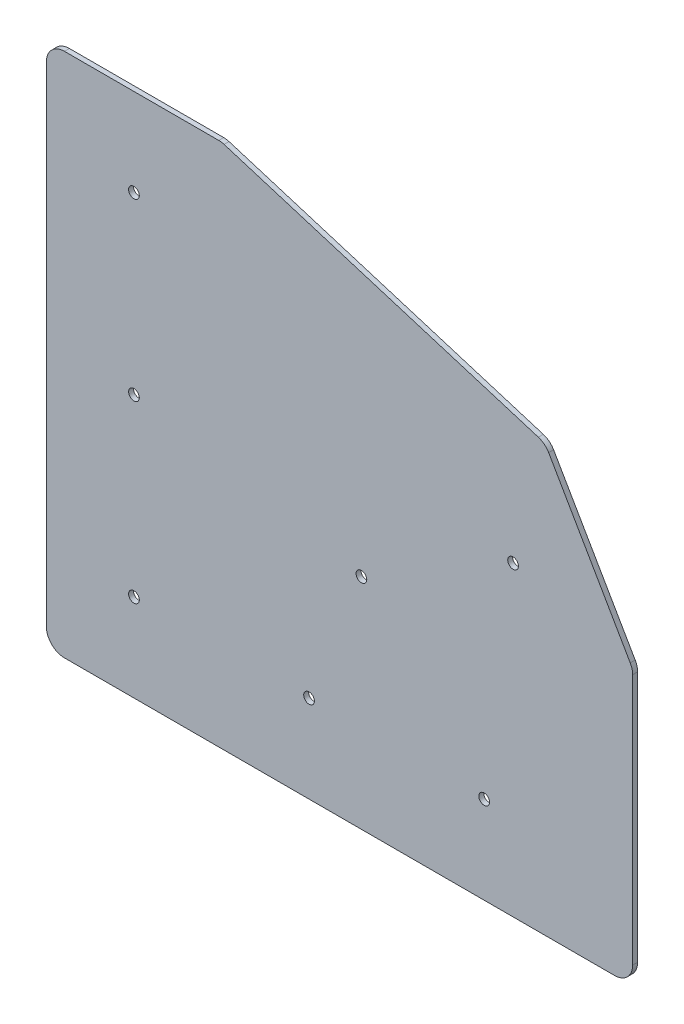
ISO-10303-21;
HEADER;
FILE_DESCRIPTION(('STEP AP214'),'2;1');
FILE_NAME('part.step','',(''),(''),'','','');
FILE_SCHEMA(('AUTOMOTIVE_DESIGN { 1 0 10303 214 1 1 1 1 }'));
ENDSEC;
DATA;
#1=APPLICATION_CONTEXT('core data for automotive mechanical design processes');
#2=APPLICATION_PROTOCOL_DEFINITION('international standard','automotive_design',2000,#1);
#3=PRODUCT_CONTEXT('',#1,'mechanical');
#4=PRODUCT('Part','Part','',(#3));
#5=PRODUCT_RELATED_PRODUCT_CATEGORY('part','',(#4));
#6=PRODUCT_DEFINITION_FORMATION('','',#4);
#7=PRODUCT_DEFINITION_CONTEXT('part definition',#1,'design');
#8=PRODUCT_DEFINITION('design','',#6,#7);
#9=PRODUCT_DEFINITION_SHAPE('','',#8);
#10=(LENGTH_UNIT() NAMED_UNIT(*) SI_UNIT(.MILLI.,.METRE.));
#11=(NAMED_UNIT(*) PLANE_ANGLE_UNIT() SI_UNIT($,.RADIAN.));
#12=(NAMED_UNIT(*) SI_UNIT($,.STERADIAN.) SOLID_ANGLE_UNIT());
#13=UNCERTAINTY_MEASURE_WITH_UNIT(LENGTH_MEASURE(1.E-05),#10,'distance_accuracy_value','');
#14=(GEOMETRIC_REPRESENTATION_CONTEXT(3) GLOBAL_UNCERTAINTY_ASSIGNED_CONTEXT((#13)) GLOBAL_UNIT_ASSIGNED_CONTEXT((#10,
#11,#12)) REPRESENTATION_CONTEXT('',''));
#15=CARTESIAN_POINT('',(0.,0.,0.));
#16=DIRECTION('',(0.,0.,1.));
#17=DIRECTION('',(1.,0.,0.));
#18=AXIS2_PLACEMENT_3D('',#15,#16,#17);
#19=CARTESIAN_POINT('',(180.7124135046,5.55625,1.524));
#20=DIRECTION('',(1.,0.,0.));
#21=DIRECTION('',(0.,0.,-1.));
#22=AXIS2_PLACEMENT_3D('',#19,#20,#21);
#23=PLANE('',#22);
#24=DIRECTION('',(0.,1.,0.));
#25=VECTOR('',#24,1.);
#26=CARTESIAN_POINT('',(180.7124135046,80.9625,1.524));
#27=LINE('',#26,#25);
#28=CARTESIAN_POINT('',(180.7124135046,5.55624999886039,1.524));
#29=VERTEX_POINT('',#28);
#30=CARTESIAN_POINT('',(180.7124135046,83.0893467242,1.524));
#31=VERTEX_POINT('',#30);
#32=EDGE_CURVE('E199',#29,#31,#27,.T.);
#33=ORIENTED_EDGE('',*,*,#32,.F.);
#34=DIRECTION('',(0.,0.,1.));
#35=VECTOR('',#34,1.);
#36=CARTESIAN_POINT('',(180.7124135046,5.55624999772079,0.762));
#37=LINE('',#36,#35);
#38=CARTESIAN_POINT('',(180.7124135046,5.55624999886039,0.));
#39=VERTEX_POINT('',#38);
#40=EDGE_CURVE('E129',#29,#39,#37,.F.);
#41=ORIENTED_EDGE('',*,*,#40,.T.);
#42=DIRECTION('',(0.,1.,0.));
#43=VECTOR('',#42,1.);
#44=CARTESIAN_POINT('',(180.7124135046,80.9625,0.));
#45=LINE('',#44,#43);
#46=CARTESIAN_POINT('',(180.7124135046,83.0893467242,0.));
#47=VERTEX_POINT('',#46);
#48=EDGE_CURVE('E223',#39,#47,#45,.T.);
#49=ORIENTED_EDGE('',*,*,#48,.T.);
#50=DIRECTION('',(0.,0.,-1.));
#51=VECTOR('',#50,1.);
#52=CARTESIAN_POINT('',(180.7124135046,83.0893467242,0.762));
#53=LINE('',#52,#51);
#54=EDGE_CURVE('E159',#47,#31,#53,.F.);
#55=ORIENTED_EDGE('',*,*,#54,.T.);
#56=EDGE_LOOP('',(#33,#41,#49,#55));
#57=FACE_BOUND('',#56,.T.);
#58=ADVANCED_FACE('F16',(#57),#23,.T.);
#59=CARTESIAN_POINT('',(175.1561635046,83.0893467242,0.));
#60=DIRECTION('',(0.,0.,1.));
#61=DIRECTION('',(1.,0.,0.));
#62=AXIS2_PLACEMENT_3D('',#59,#60,#61);
#63=CYLINDRICAL_SURFACE('',#62,5.55625000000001);
#64=ORIENTED_EDGE('',*,*,#54,.F.);
#65=CARTESIAN_POINT('',(175.1561635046,83.0893467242,0.));
#66=DIRECTION('',(0.,0.,1.));
#67=DIRECTION('',(1.,0.,0.));
#68=AXIS2_PLACEMENT_3D('',#65,#66,#67);
#69=CIRCLE('',#68,5.55625000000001);
#70=CARTESIAN_POINT('',(179.968017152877,85.8674717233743,0.));
#71=VERTEX_POINT('',#70);
#72=EDGE_CURVE('E220',#47,#71,#69,.T.);
#73=ORIENTED_EDGE('',*,*,#72,.T.);
#74=DIRECTION('',(0.,0.,1.));
#75=VECTOR('',#74,1.);
#76=CARTESIAN_POINT('',(179.9680171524,85.8674717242,0.762));
#77=LINE('',#76,#75);
#78=CARTESIAN_POINT('',(179.968017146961,85.8674717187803,1.524));
#79=VERTEX_POINT('',#78);
#80=EDGE_CURVE('E156',#71,#79,#77,.T.);
#81=ORIENTED_EDGE('',*,*,#80,.T.);
#82=CARTESIAN_POINT('',(175.1561635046,83.0893467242,1.524));
#83=DIRECTION('',(0.,0.,1.));
#84=DIRECTION('',(1.,0.,0.));
#85=AXIS2_PLACEMENT_3D('',#82,#83,#84);
#86=CIRCLE('',#85,5.55625000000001);
#87=EDGE_CURVE('E197',#31,#79,#86,.T.);
#88=ORIENTED_EDGE('',*,*,#87,.F.);
#89=EDGE_LOOP('',(#64,#73,#81,#88));
#90=FACE_BOUND('',#89,.T.);
#91=ADVANCED_FACE('F266',(#90),#63,.T.);
#92=CARTESIAN_POINT('',(154.8176796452,129.4291341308,0.));
#93=DIRECTION('',(-0.866025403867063,-0.49999999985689,0.));
#94=DIRECTION('',(0.49999999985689,-0.866025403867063,0.));
#95=AXIS2_PLACEMENT_3D('',#92,#93,#94);
#96=PLANE('',#95);
#97=ORIENTED_EDGE('',*,*,#80,.F.);
#98=DIRECTION('',(0.49999999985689,-0.866025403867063,0.));
#99=VECTOR('',#98,1.);
#100=CARTESIAN_POINT('',(154.8176796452,129.4291341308,0.));
#101=LINE('',#100,#99);
#102=CARTESIAN_POINT('',(154.817679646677,129.429134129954,0.));
#103=VERTEX_POINT('',#102);
#104=EDGE_CURVE('E218',#71,#103,#101,.F.);
#105=ORIENTED_EDGE('',*,*,#104,.T.);
#106=DIRECTION('',(0.,0.,-1.));
#107=VECTOR('',#106,1.);
#108=CARTESIAN_POINT('',(154.817679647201,129.429134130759,0.762));
#109=LINE('',#108,#107);
#110=CARTESIAN_POINT('',(154.817679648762,129.429134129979,1.524));
#111=VERTEX_POINT('',#110);
#112=EDGE_CURVE('E104',#103,#111,#109,.F.);
#113=ORIENTED_EDGE('',*,*,#112,.T.);
#114=DIRECTION('',(-0.499999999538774,0.866025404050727,0.));
#115=VECTOR('',#114,1.);
#116=CARTESIAN_POINT('',(179.968017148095,85.867471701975,1.524));
#117=LINE('',#116,#115);
#118=EDGE_CURVE('E195',#79,#111,#117,.T.);
#119=ORIENTED_EDGE('',*,*,#118,.F.);
#120=EDGE_LOOP('',(#97,#105,#113,#119));
#121=FACE_BOUND('',#120,.T.);
#122=ADVANCED_FACE('F269',(#121),#96,.F.);
#123=CARTESIAN_POINT('',(150.0058259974,126.6510091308,1.524));
#124=DIRECTION('',(0.,0.,-1.));
#125=DIRECTION('',(0.,1.,0.));
#126=AXIS2_PLACEMENT_3D('',#123,#124,#125);
#127=CYLINDRICAL_SURFACE('',#126,5.55625000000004);
#128=ORIENTED_EDGE('',*,*,#112,.F.);
#129=CARTESIAN_POINT('',(150.0058259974,126.6510091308,0.));
#130=DIRECTION('',(0.,0.,-1.));
#131=DIRECTION('',(0.,1.,0.));
#132=AXIS2_PLACEMENT_3D('',#129,#130,#131);
#133=CIRCLE('',#132,5.55625000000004);
#134=CARTESIAN_POINT('',(151.635503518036,131.962888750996,0.));
#135=VERTEX_POINT('',#134);
#136=EDGE_CURVE('E20',#103,#135,#133,.F.);
#137=ORIENTED_EDGE('',*,*,#136,.T.);
#138=DIRECTION('',(0.,0.,1.));
#139=VECTOR('',#138,1.);
#140=CARTESIAN_POINT('',(151.6355035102,131.9628887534,0.762));
#141=LINE('',#140,#139);
#142=CARTESIAN_POINT('',(151.63550352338,131.962888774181,1.524));
#143=VERTEX_POINT('',#142);
#144=EDGE_CURVE('E111',#135,#143,#141,.T.);
#145=ORIENTED_EDGE('',*,*,#144,.T.);
#146=CARTESIAN_POINT('',(150.0058259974,126.6510091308,1.524));
#147=DIRECTION('',(0.,0.,-1.));
#148=DIRECTION('',(0.,1.,0.));
#149=AXIS2_PLACEMENT_3D('',#146,#147,#148);
#150=CIRCLE('',#149,5.55625000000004);
#151=EDGE_CURVE('E193',#111,#143,#150,.F.);
#152=ORIENTED_EDGE('',*,*,#151,.F.);
#153=EDGE_LOOP('',(#128,#137,#145,#152));
#154=FACE_BOUND('',#153,.T.);
#155=ADVANCED_FACE('F128',(#154),#127,.T.);
#156=CARTESIAN_POINT('',(54.771517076,161.6806296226,0.));
#157=DIRECTION('',(-0.29330529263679,-0.956018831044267,0.));
#158=DIRECTION('',(0.956018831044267,-0.29330529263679,0.));
#159=AXIS2_PLACEMENT_3D('',#156,#157,#158);
#160=PLANE('',#159);
#161=ORIENTED_EDGE('',*,*,#144,.F.);
#162=DIRECTION('',(0.956018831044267,-0.29330529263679,0.));
#163=VECTOR('',#162,1.);
#164=CARTESIAN_POINT('',(54.771517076,161.6806296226,0.));
#165=LINE('',#164,#163);
#166=CARTESIAN_POINT('',(54.771517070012,161.680629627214,0.));
#167=VERTEX_POINT('',#166);
#168=EDGE_CURVE('E115',#135,#167,#165,.F.);
#169=ORIENTED_EDGE('',*,*,#168,.T.);
#170=DIRECTION('',(0.,0.,-1.));
#171=VECTOR('',#170,1.);
#172=CARTESIAN_POINT('',(54.7715170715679,161.680629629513,0.762));
#173=LINE('',#172,#171);
#174=CARTESIAN_POINT('',(54.7715170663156,161.680629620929,1.524));
#175=VERTEX_POINT('',#174);
#176=EDGE_CURVE('E117',#167,#175,#173,.F.);
#177=ORIENTED_EDGE('',*,*,#176,.T.);
#178=DIRECTION('',(-0.956018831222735,0.293305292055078,0.));
#179=VECTOR('',#178,1.);
#180=CARTESIAN_POINT('',(151.635503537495,131.962888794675,1.524));
#181=LINE('',#180,#179);
#182=EDGE_CURVE('E116',#143,#175,#181,.T.);
#183=ORIENTED_EDGE('',*,*,#182,.F.);
#184=EDGE_LOOP('',(#161,#169,#177,#183));
#185=FACE_BOUND('',#184,.T.);
#186=ADVANCED_FACE('F113',(#185),#160,.F.);
#187=CARTESIAN_POINT('',(53.1418395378,156.36875,1.524));
#188=DIRECTION('',(0.,0.,-1.));
#189=DIRECTION('',(0.,1.,0.));
#190=AXIS2_PLACEMENT_3D('',#187,#188,#189);
#191=CYLINDRICAL_SURFACE('',#190,5.55624999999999);
#192=ORIENTED_EDGE('',*,*,#176,.F.);
#193=CARTESIAN_POINT('',(53.1418395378,156.36875,0.));
#194=DIRECTION('',(0.,0.,-1.));
#195=DIRECTION('',(0.,1.,0.));
#196=AXIS2_PLACEMENT_3D('',#193,#194,#195);
#197=CIRCLE('',#196,5.55624999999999);
#198=CARTESIAN_POINT('',(53.1418395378,161.925,0.));
#199=VERTEX_POINT('',#198);
#200=EDGE_CURVE('E127',#167,#199,#197,.F.);
#201=ORIENTED_EDGE('',*,*,#200,.T.);
#202=DIRECTION('',(0.,0.,1.));
#203=VECTOR('',#202,1.);
#204=CARTESIAN_POINT('',(53.1418395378,161.925,0.762));
#205=LINE('',#204,#203);
#206=CARTESIAN_POINT('',(53.1418395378,161.925,1.524));
#207=VERTEX_POINT('',#206);
#208=EDGE_CURVE('E151',#199,#207,#205,.T.);
#209=ORIENTED_EDGE('',*,*,#208,.T.);
#210=CARTESIAN_POINT('',(53.1418395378,156.36875,1.524));
#211=DIRECTION('',(0.,0.,-1.));
#212=DIRECTION('',(0.,1.,0.));
#213=AXIS2_PLACEMENT_3D('',#210,#211,#212);
#214=CIRCLE('',#213,5.55624999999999);
#215=EDGE_CURVE('E190',#175,#207,#214,.F.);
#216=ORIENTED_EDGE('',*,*,#215,.F.);
#217=EDGE_LOOP('',(#192,#201,#209,#216));
#218=FACE_BOUND('',#217,.T.);
#219=ADVANCED_FACE('F276',(#218),#191,.T.);
#220=CARTESIAN_POINT('',(5.55625,161.925,0.));
#221=DIRECTION('',(0.,-1.,0.));
#222=DIRECTION('',(1.,0.,0.));
#223=AXIS2_PLACEMENT_3D('',#220,#221,#222);
#224=PLANE('',#223);
#225=ORIENTED_EDGE('',*,*,#208,.F.);
#226=DIRECTION('',(-1.,0.,0.));
#227=VECTOR('',#226,1.);
#228=CARTESIAN_POINT('',(90.3562067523,161.925,0.));
#229=LINE('',#228,#227);
#230=CARTESIAN_POINT('',(5.5562500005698,161.925,0.));
#231=VERTEX_POINT('',#230);
#232=EDGE_CURVE('E235',#199,#231,#229,.T.);
#233=ORIENTED_EDGE('',*,*,#232,.T.);
#234=DIRECTION('',(0.,0.,-1.));
#235=VECTOR('',#234,1.);
#236=CARTESIAN_POINT('',(5.5562500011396,161.925,0.762));
#237=LINE('',#236,#235);
#238=CARTESIAN_POINT('',(5.5562500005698,161.925,1.524));
#239=VERTEX_POINT('',#238);
#240=EDGE_CURVE('E148',#231,#239,#237,.F.);
#241=ORIENTED_EDGE('',*,*,#240,.T.);
#242=DIRECTION('',(-1.,0.,0.));
#243=VECTOR('',#242,1.);
#244=CARTESIAN_POINT('',(90.3562067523,161.925,1.524));
#245=LINE('',#244,#243);
#246=EDGE_CURVE('E189',#207,#239,#245,.T.);
#247=ORIENTED_EDGE('',*,*,#246,.F.);
#248=EDGE_LOOP('',(#225,#233,#241,#247));
#249=FACE_BOUND('',#248,.T.);
#250=ADVANCED_FACE('F274',(#249),#224,.F.);
#251=CARTESIAN_POINT('',(5.55625,156.36875,1.524));
#252=DIRECTION('',(0.,0.,-1.));
#253=DIRECTION('',(0.,1.,0.));
#254=AXIS2_PLACEMENT_3D('',#251,#252,#253);
#255=CYLINDRICAL_SURFACE('',#254,5.55625);
#256=ORIENTED_EDGE('',*,*,#240,.F.);
#257=CARTESIAN_POINT('',(5.55625,156.36875,0.));
#258=DIRECTION('',(0.,0.,-1.));
#259=DIRECTION('',(0.,1.,0.));
#260=AXIS2_PLACEMENT_3D('',#257,#258,#259);
#261=CIRCLE('',#260,5.55625);
#262=CARTESIAN_POINT('',(0.,156.36875,0.));
#263=VERTEX_POINT('',#262);
#264=EDGE_CURVE('E232',#231,#263,#261,.F.);
#265=ORIENTED_EDGE('',*,*,#264,.T.);
#266=DIRECTION('',(0.,0.,1.));
#267=VECTOR('',#266,1.);
#268=CARTESIAN_POINT('',(0.,156.36875,0.762));
#269=LINE('',#268,#267);
#270=CARTESIAN_POINT('',(0.,156.36875,1.524));
#271=VERTEX_POINT('',#270);
#272=EDGE_CURVE('E145',#263,#271,#269,.T.);
#273=ORIENTED_EDGE('',*,*,#272,.T.);
#274=CARTESIAN_POINT('',(5.55625,156.36875,1.524));
#275=DIRECTION('',(0.,0.,-1.));
#276=DIRECTION('',(0.,1.,0.));
#277=AXIS2_PLACEMENT_3D('',#274,#275,#276);
#278=CIRCLE('',#277,5.55625);
#279=EDGE_CURVE('E187',#239,#271,#278,.F.);
#280=ORIENTED_EDGE('',*,*,#279,.F.);
#281=EDGE_LOOP('',(#256,#265,#273,#280));
#282=FACE_BOUND('',#281,.T.);
#283=ADVANCED_FACE('F272',(#282),#255,.T.);
#284=CARTESIAN_POINT('',(0.,5.55625,0.));
#285=DIRECTION('',(1.,0.,0.));
#286=DIRECTION('',(0.,1.,0.));
#287=AXIS2_PLACEMENT_3D('',#284,#285,#286);
#288=PLANE('',#287);
#289=DIRECTION('',(0.,0.,-1.));
#290=VECTOR('',#289,1.);
#291=CARTESIAN_POINT('',(0.,5.55624999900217,0.762));
#292=LINE('',#291,#290);
#293=CARTESIAN_POINT('',(0.,5.55624999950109,0.));
#294=VERTEX_POINT('',#293);
#295=CARTESIAN_POINT('',(0.,5.55624999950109,1.524));
#296=VERTEX_POINT('',#295);
#297=EDGE_CURVE('E142',#294,#296,#292,.F.);
#298=ORIENTED_EDGE('',*,*,#297,.T.);
#299=DIRECTION('',(0.,-1.,0.));
#300=VECTOR('',#299,1.);
#301=CARTESIAN_POINT('',(0.,80.9625,1.524));
#302=LINE('',#301,#300);
#303=EDGE_CURVE('E186',#271,#296,#302,.T.);
#304=ORIENTED_EDGE('',*,*,#303,.F.);
#305=ORIENTED_EDGE('',*,*,#272,.F.);
#306=DIRECTION('',(0.,-1.,0.));
#307=VECTOR('',#306,1.);
#308=CARTESIAN_POINT('',(0.,80.9625,0.));
#309=LINE('',#308,#307);
#310=EDGE_CURVE('E231',#263,#294,#309,.T.);
#311=ORIENTED_EDGE('',*,*,#310,.T.);
#312=EDGE_LOOP('',(#298,#304,#305,#311));
#313=FACE_BOUND('',#312,.T.);
#314=ADVANCED_FACE('F252',(#313),#288,.F.);
#315=CARTESIAN_POINT('',(5.55625,5.55625,1.524));
#316=DIRECTION('',(0.,0.,-1.));
#317=DIRECTION('',(0.,1.,0.));
#318=AXIS2_PLACEMENT_3D('',#315,#316,#317);
#319=CYLINDRICAL_SURFACE('',#318,5.55625);
#320=ORIENTED_EDGE('',*,*,#297,.F.);
#321=CARTESIAN_POINT('',(5.55625,5.55625,0.));
#322=DIRECTION('',(0.,0.,-1.));
#323=DIRECTION('',(0.,1.,0.));
#324=AXIS2_PLACEMENT_3D('',#321,#322,#323);
#325=CIRCLE('',#324,5.55625);
#326=CARTESIAN_POINT('',(5.55625,0.,0.));
#327=VERTEX_POINT('',#326);
#328=EDGE_CURVE('E228',#294,#327,#325,.F.);
#329=ORIENTED_EDGE('',*,*,#328,.T.);
#330=DIRECTION('',(0.,0.,1.));
#331=VECTOR('',#330,1.);
#332=CARTESIAN_POINT('',(5.55625,0.,0.762));
#333=LINE('',#332,#331);
#334=CARTESIAN_POINT('',(5.55625,0.,1.524));
#335=VERTEX_POINT('',#334);
#336=EDGE_CURVE('E136',#327,#335,#333,.T.);
#337=ORIENTED_EDGE('',*,*,#336,.T.);
#338=CARTESIAN_POINT('',(5.55625,5.55625,1.524));
#339=DIRECTION('',(0.,0.,-1.));
#340=DIRECTION('',(0.,1.,0.));
#341=AXIS2_PLACEMENT_3D('',#338,#339,#340);
#342=CIRCLE('',#341,5.55625);
#343=EDGE_CURVE('E184',#296,#335,#342,.F.);
#344=ORIENTED_EDGE('',*,*,#343,.F.);
#345=EDGE_LOOP('',(#320,#329,#337,#344));
#346=FACE_BOUND('',#345,.T.);
#347=ADVANCED_FACE('F256',(#346),#319,.T.);
#348=CARTESIAN_POINT('',(5.55625,0.,0.));
#349=DIRECTION('',(0.,1.,0.));
#350=DIRECTION('',(0.,0.,1.));
#351=AXIS2_PLACEMENT_3D('',#348,#349,#350);
#352=PLANE('',#351);
#353=DIRECTION('',(0.,0.,-1.));
#354=VECTOR('',#353,1.);
#355=CARTESIAN_POINT('',(175.156163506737,0.,0.762));
#356=LINE('',#355,#354);
#357=CARTESIAN_POINT('',(175.156163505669,0.,0.));
#358=VERTEX_POINT('',#357);
#359=CARTESIAN_POINT('',(175.156163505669,0.,1.524));
#360=VERTEX_POINT('',#359);
#361=EDGE_CURVE('E130',#358,#360,#356,.F.);
#362=ORIENTED_EDGE('',*,*,#361,.T.);
#363=DIRECTION('',(1.,0.,0.));
#364=VECTOR('',#363,1.);
#365=CARTESIAN_POINT('',(90.3562067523,0.,1.524));
#366=LINE('',#365,#364);
#367=EDGE_CURVE('E35',#335,#360,#366,.T.);
#368=ORIENTED_EDGE('',*,*,#367,.F.);
#369=ORIENTED_EDGE('',*,*,#336,.F.);
#370=DIRECTION('',(1.,0.,0.));
#371=VECTOR('',#370,1.);
#372=CARTESIAN_POINT('',(90.3562067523,0.,0.));
#373=LINE('',#372,#371);
#374=EDGE_CURVE('E227',#327,#358,#373,.T.);
#375=ORIENTED_EDGE('',*,*,#374,.T.);
#376=EDGE_LOOP('',(#362,#368,#369,#375));
#377=FACE_BOUND('',#376,.T.);
#378=ADVANCED_FACE('F259',(#377),#352,.F.);
#379=CARTESIAN_POINT('',(175.1561635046,5.55625,1.524));
#380=DIRECTION('',(0.,0.,-1.));
#381=DIRECTION('',(0.,1.,0.));
#382=AXIS2_PLACEMENT_3D('',#379,#380,#381);
#383=CYLINDRICAL_SURFACE('',#382,5.55624999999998);
#384=ORIENTED_EDGE('',*,*,#40,.F.);
#385=CARTESIAN_POINT('',(175.1561635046,5.55625,1.524));
#386=DIRECTION('',(0.,0.,-1.));
#387=DIRECTION('',(0.,1.,0.));
#388=AXIS2_PLACEMENT_3D('',#385,#386,#387);
#389=CIRCLE('',#388,5.55624999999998);
#390=EDGE_CURVE('E182',#360,#29,#389,.F.);
#391=ORIENTED_EDGE('',*,*,#390,.F.);
#392=ORIENTED_EDGE('',*,*,#361,.F.);
#393=CARTESIAN_POINT('',(175.1561635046,5.55625,0.));
#394=DIRECTION('',(0.,0.,-1.));
#395=DIRECTION('',(0.,1.,0.));
#396=AXIS2_PLACEMENT_3D('',#393,#394,#395);
#397=CIRCLE('',#396,5.55624999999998);
#398=EDGE_CURVE('E224',#358,#39,#397,.F.);
#399=ORIENTED_EDGE('',*,*,#398,.T.);
#400=EDGE_LOOP('',(#384,#391,#392,#399));
#401=FACE_BOUND('',#400,.T.);
#402=ADVANCED_FACE('F263',(#401),#383,.T.);
#403=CARTESIAN_POINT('',(143.8468029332,94.45625,0.));
#404=DIRECTION('',(0.,0.,1.));
#405=DIRECTION('',(1.,0.,0.));
#406=AXIS2_PLACEMENT_3D('',#403,#404,#405);
#407=CYLINDRICAL_SURFACE('',#406,1.65100000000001);
#408=CARTESIAN_POINT('',(143.8468029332,94.45625,1.524));
#409=DIRECTION('',(0.,0.,1.));
#410=DIRECTION('',(1.,0.,0.));
#411=AXIS2_PLACEMENT_3D('',#408,#409,#410);
#412=CIRCLE('',#411,1.65100000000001);
#413=CARTESIAN_POINT('',(145.4978029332,94.45625,1.524));
#414=VERTEX_POINT('',#413);
#415=EDGE_CURVE('E179',#414,#414,#412,.F.);
#416=ORIENTED_EDGE('',*,*,#415,.F.);
#417=EDGE_LOOP('',(#416));
#418=FACE_BOUND('',#417,.T.);
#419=CARTESIAN_POINT('',(143.8468029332,94.45625,0.));
#420=DIRECTION('',(0.,0.,1.));
#421=DIRECTION('',(1.,0.,0.));
#422=AXIS2_PLACEMENT_3D('',#419,#420,#421);
#423=CIRCLE('',#422,1.65100000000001);
#424=CARTESIAN_POINT('',(145.4978029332,94.45625,0.));
#425=VERTEX_POINT('',#424);
#426=EDGE_CURVE('E215',#425,#425,#423,.F.);
#427=ORIENTED_EDGE('',*,*,#426,.T.);
#428=EDGE_LOOP('',(#427));
#429=FACE_BOUND('',#428,.T.);
#430=ADVANCED_FACE('F317',(#418,#429),#407,.F.);
#431=CARTESIAN_POINT('',(97.103081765,67.46875,0.));
#432=DIRECTION('',(0.,0.,1.));
#433=DIRECTION('',(1.,0.,0.));
#434=AXIS2_PLACEMENT_3D('',#431,#432,#433);
#435=CYLINDRICAL_SURFACE('',#434,1.65100000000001);
#436=CARTESIAN_POINT('',(97.103081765,67.46875,1.524));
#437=DIRECTION('',(0.,0.,1.));
#438=DIRECTION('',(1.,0.,0.));
#439=AXIS2_PLACEMENT_3D('',#436,#437,#438);
#440=CIRCLE('',#439,1.65100000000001);
#441=CARTESIAN_POINT('',(98.754081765,67.46875,1.524));
#442=VERTEX_POINT('',#441);
#443=EDGE_CURVE('E176',#442,#442,#440,.F.);
#444=ORIENTED_EDGE('',*,*,#443,.F.);
#445=EDGE_LOOP('',(#444));
#446=FACE_BOUND('',#445,.T.);
#447=CARTESIAN_POINT('',(97.103081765,67.46875,0.));
#448=DIRECTION('',(0.,0.,1.));
#449=DIRECTION('',(1.,0.,0.));
#450=AXIS2_PLACEMENT_3D('',#447,#448,#449);
#451=CIRCLE('',#450,1.65100000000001);
#452=CARTESIAN_POINT('',(98.754081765,67.46875,0.));
#453=VERTEX_POINT('',#452);
#454=EDGE_CURVE('E212',#453,#453,#451,.F.);
#455=ORIENTED_EDGE('',*,*,#454,.T.);
#456=EDGE_LOOP('',(#455));
#457=FACE_BOUND('',#456,.T.);
#458=ADVANCED_FACE('F313',(#446,#457),#435,.F.);
#459=CARTESIAN_POINT('',(134.9375,26.9875,0.));
#460=DIRECTION('',(0.,0.,1.));
#461=DIRECTION('',(1.,0.,0.));
#462=AXIS2_PLACEMENT_3D('',#459,#460,#461);
#463=CYLINDRICAL_SURFACE('',#462,1.65100000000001);
#464=CARTESIAN_POINT('',(134.9375,26.9875,1.524));
#465=DIRECTION('',(0.,0.,1.));
#466=DIRECTION('',(1.,0.,0.));
#467=AXIS2_PLACEMENT_3D('',#464,#465,#466);
#468=CIRCLE('',#467,1.65100000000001);
#469=CARTESIAN_POINT('',(136.5885,26.9875,1.524));
#470=VERTEX_POINT('',#469);
#471=EDGE_CURVE('E173',#470,#470,#468,.F.);
#472=ORIENTED_EDGE('',*,*,#471,.F.);
#473=EDGE_LOOP('',(#472));
#474=FACE_BOUND('',#473,.T.);
#475=CARTESIAN_POINT('',(134.9375,26.9875,0.));
#476=DIRECTION('',(0.,0.,1.));
#477=DIRECTION('',(1.,0.,0.));
#478=AXIS2_PLACEMENT_3D('',#475,#476,#477);
#479=CIRCLE('',#478,1.65100000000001);
#480=CARTESIAN_POINT('',(136.5885,26.9875,0.));
#481=VERTEX_POINT('',#480);
#482=EDGE_CURVE('E209',#481,#481,#479,.F.);
#483=ORIENTED_EDGE('',*,*,#482,.T.);
#484=EDGE_LOOP('',(#483));
#485=FACE_BOUND('',#484,.T.);
#486=ADVANCED_FACE('F309',(#474,#485),#463,.F.);
#487=CARTESIAN_POINT('',(26.9875,26.9875,0.));
#488=DIRECTION('',(0.,0.,1.));
#489=DIRECTION('',(1.,0.,0.));
#490=AXIS2_PLACEMENT_3D('',#487,#488,#489);
#491=CYLINDRICAL_SURFACE('',#490,1.651);
#492=CARTESIAN_POINT('',(26.9875,26.9875,1.524));
#493=DIRECTION('',(0.,0.,1.));
#494=DIRECTION('',(1.,0.,0.));
#495=AXIS2_PLACEMENT_3D('',#492,#493,#494);
#496=CIRCLE('',#495,1.651);
#497=CARTESIAN_POINT('',(28.6385,26.9875,1.524));
#498=VERTEX_POINT('',#497);
#499=EDGE_CURVE('E170',#498,#498,#496,.F.);
#500=ORIENTED_EDGE('',*,*,#499,.F.);
#501=EDGE_LOOP('',(#500));
#502=FACE_BOUND('',#501,.T.);
#503=CARTESIAN_POINT('',(26.9875,26.9875,0.));
#504=DIRECTION('',(0.,0.,1.));
#505=DIRECTION('',(1.,0.,0.));
#506=AXIS2_PLACEMENT_3D('',#503,#504,#505);
#507=CIRCLE('',#506,1.651);
#508=CARTESIAN_POINT('',(28.6385,26.9875,0.));
#509=VERTEX_POINT('',#508);
#510=EDGE_CURVE('E206',#509,#509,#507,.F.);
#511=ORIENTED_EDGE('',*,*,#510,.T.);
#512=EDGE_LOOP('',(#511));
#513=FACE_BOUND('',#512,.T.);
#514=ADVANCED_FACE('F305',(#502,#513),#491,.F.);
#515=CARTESIAN_POINT('',(26.9875,80.9625,0.));
#516=DIRECTION('',(0.,0.,1.));
#517=DIRECTION('',(1.,0.,0.));
#518=AXIS2_PLACEMENT_3D('',#515,#516,#517);
#519=CYLINDRICAL_SURFACE('',#518,1.651);
#520=CARTESIAN_POINT('',(26.9875,80.9625,1.524));
#521=DIRECTION('',(0.,0.,1.));
#522=DIRECTION('',(1.,0.,0.));
#523=AXIS2_PLACEMENT_3D('',#520,#521,#522);
#524=CIRCLE('',#523,1.651);
#525=CARTESIAN_POINT('',(28.6385,80.9625,1.524));
#526=VERTEX_POINT('',#525);
#527=EDGE_CURVE('E167',#526,#526,#524,.F.);
#528=ORIENTED_EDGE('',*,*,#527,.F.);
#529=EDGE_LOOP('',(#528));
#530=FACE_BOUND('',#529,.T.);
#531=CARTESIAN_POINT('',(26.9875,80.9625,0.));
#532=DIRECTION('',(0.,0.,1.));
#533=DIRECTION('',(1.,0.,0.));
#534=AXIS2_PLACEMENT_3D('',#531,#532,#533);
#535=CIRCLE('',#534,1.651);
#536=CARTESIAN_POINT('',(28.6385,80.9625,0.));
#537=VERTEX_POINT('',#536);
#538=EDGE_CURVE('E203',#537,#537,#535,.F.);
#539=ORIENTED_EDGE('',*,*,#538,.T.);
#540=EDGE_LOOP('',(#539));
#541=FACE_BOUND('',#540,.T.);
#542=ADVANCED_FACE('F301',(#530,#541),#519,.F.);
#543=CARTESIAN_POINT('',(26.9875,134.9375,0.));
#544=DIRECTION('',(0.,0.,1.));
#545=DIRECTION('',(1.,0.,0.));
#546=AXIS2_PLACEMENT_3D('',#543,#544,#545);
#547=CYLINDRICAL_SURFACE('',#546,1.651);
#548=CARTESIAN_POINT('',(26.9875,134.9375,1.524));
#549=DIRECTION('',(0.,0.,1.));
#550=DIRECTION('',(1.,0.,0.));
#551=AXIS2_PLACEMENT_3D('',#548,#549,#550);
#552=CIRCLE('',#551,1.651);
#553=CARTESIAN_POINT('',(28.6385,134.9375,1.524));
#554=VERTEX_POINT('',#553);
#555=EDGE_CURVE('E164',#554,#554,#552,.F.);
#556=ORIENTED_EDGE('',*,*,#555,.F.);
#557=EDGE_LOOP('',(#556));
#558=FACE_BOUND('',#557,.T.);
#559=CARTESIAN_POINT('',(26.9875,134.9375,0.));
#560=DIRECTION('',(0.,0.,1.));
#561=DIRECTION('',(1.,0.,0.));
#562=AXIS2_PLACEMENT_3D('',#559,#560,#561);
#563=CIRCLE('',#562,1.651);
#564=CARTESIAN_POINT('',(28.6385,134.9375,0.));
#565=VERTEX_POINT('',#564);
#566=EDGE_CURVE('E200',#565,#565,#563,.F.);
#567=ORIENTED_EDGE('',*,*,#566,.T.);
#568=EDGE_LOOP('',(#567));
#569=FACE_BOUND('',#568,.T.);
#570=ADVANCED_FACE('F298',(#558,#569),#547,.F.);
#571=CARTESIAN_POINT('',(0.,0.,0.));
#572=DIRECTION('',(0.,0.,1.));
#573=DIRECTION('',(1.,0.,0.));
#574=AXIS2_PLACEMENT_3D('',#571,#572,#573);
#575=PLANE('',#574);
#576=ORIENTED_EDGE('',*,*,#566,.F.);
#577=EDGE_LOOP('',(#576));
#578=FACE_BOUND('',#577,.T.);
#579=ORIENTED_EDGE('',*,*,#538,.F.);
#580=EDGE_LOOP('',(#579));
#581=FACE_BOUND('',#580,.T.);
#582=ORIENTED_EDGE('',*,*,#510,.F.);
#583=EDGE_LOOP('',(#582));
#584=FACE_BOUND('',#583,.T.);
#585=ORIENTED_EDGE('',*,*,#482,.F.);
#586=EDGE_LOOP('',(#585));
#587=FACE_BOUND('',#586,.T.);
#588=ORIENTED_EDGE('',*,*,#454,.F.);
#589=EDGE_LOOP('',(#588));
#590=FACE_BOUND('',#589,.T.);
#591=ORIENTED_EDGE('',*,*,#426,.F.);
#592=EDGE_LOOP('',(#591));
#593=FACE_BOUND('',#592,.T.);
#594=CARTESIAN_POINT('',(80.9625,26.9875,0.));
#595=DIRECTION('',(0.,0.,1.));
#596=DIRECTION('',(1.,0.,0.));
#597=AXIS2_PLACEMENT_3D('',#594,#595,#596);
#598=CIRCLE('',#597,1.65099999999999);
#599=CARTESIAN_POINT('',(82.6135,26.9875,0.));
#600=VERTEX_POINT('',#599);
#601=EDGE_CURVE('E26',#600,#600,#598,.F.);
#602=ORIENTED_EDGE('',*,*,#601,.F.);
#603=EDGE_LOOP('',(#602));
#604=FACE_BOUND('',#603,.T.);
#605=ORIENTED_EDGE('',*,*,#72,.F.);
#606=ORIENTED_EDGE('',*,*,#48,.F.);
#607=ORIENTED_EDGE('',*,*,#398,.F.);
#608=ORIENTED_EDGE('',*,*,#374,.F.);
#609=ORIENTED_EDGE('',*,*,#328,.F.);
#610=ORIENTED_EDGE('',*,*,#310,.F.);
#611=ORIENTED_EDGE('',*,*,#264,.F.);
#612=ORIENTED_EDGE('',*,*,#232,.F.);
#613=ORIENTED_EDGE('',*,*,#200,.F.);
#614=ORIENTED_EDGE('',*,*,#168,.F.);
#615=ORIENTED_EDGE('',*,*,#136,.F.);
#616=ORIENTED_EDGE('',*,*,#104,.F.);
#617=EDGE_LOOP('',(#605,#606,#607,#608,#609,#610,#611,#612,#613,#614,#615,#616));
#618=FACE_BOUND('',#617,.T.);
#619=ADVANCED_FACE('F122',(#578,#581,#584,#587,#590,#593,#604,#618),#575,.F.);
#620=CARTESIAN_POINT('',(0.,0.,1.524));
#621=DIRECTION('',(0.,0.,1.));
#622=DIRECTION('',(1.,0.,0.));
#623=AXIS2_PLACEMENT_3D('',#620,#621,#622);
#624=PLANE('',#623);
#625=ORIENTED_EDGE('',*,*,#555,.T.);
#626=EDGE_LOOP('',(#625));
#627=FACE_BOUND('',#626,.T.);
#628=ORIENTED_EDGE('',*,*,#527,.T.);
#629=EDGE_LOOP('',(#628));
#630=FACE_BOUND('',#629,.T.);
#631=ORIENTED_EDGE('',*,*,#499,.T.);
#632=EDGE_LOOP('',(#631));
#633=FACE_BOUND('',#632,.T.);
#634=ORIENTED_EDGE('',*,*,#471,.T.);
#635=EDGE_LOOP('',(#634));
#636=FACE_BOUND('',#635,.T.);
#637=ORIENTED_EDGE('',*,*,#443,.T.);
#638=EDGE_LOOP('',(#637));
#639=FACE_BOUND('',#638,.T.);
#640=ORIENTED_EDGE('',*,*,#415,.T.);
#641=EDGE_LOOP('',(#640));
#642=FACE_BOUND('',#641,.T.);
#643=CARTESIAN_POINT('',(80.9625,26.9875,1.524));
#644=DIRECTION('',(0.,0.,1.));
#645=DIRECTION('',(1.,0.,0.));
#646=AXIS2_PLACEMENT_3D('',#643,#644,#645);
#647=CIRCLE('',#646,1.65099999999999);
#648=CARTESIAN_POINT('',(82.6135,26.9875,1.524));
#649=VERTEX_POINT('',#648);
#650=EDGE_CURVE('E10',#649,#649,#647,.T.);
#651=ORIENTED_EDGE('',*,*,#650,.F.);
#652=EDGE_LOOP('',(#651));
#653=FACE_BOUND('',#652,.T.);
#654=ORIENTED_EDGE('',*,*,#367,.T.);
#655=ORIENTED_EDGE('',*,*,#390,.T.);
#656=ORIENTED_EDGE('',*,*,#32,.T.);
#657=ORIENTED_EDGE('',*,*,#87,.T.);
#658=ORIENTED_EDGE('',*,*,#118,.T.);
#659=ORIENTED_EDGE('',*,*,#151,.T.);
#660=ORIENTED_EDGE('',*,*,#182,.T.);
#661=ORIENTED_EDGE('',*,*,#215,.T.);
#662=ORIENTED_EDGE('',*,*,#246,.T.);
#663=ORIENTED_EDGE('',*,*,#279,.T.);
#664=ORIENTED_EDGE('',*,*,#303,.T.);
#665=ORIENTED_EDGE('',*,*,#343,.T.);
#666=EDGE_LOOP('',(#654,#655,#656,#657,#658,#659,#660,#661,#662,#663,#664,#665));
#667=FACE_BOUND('',#666,.T.);
#668=ADVANCED_FACE('F18',(#627,#630,#633,#636,#639,#642,#653,#667),#624,.T.);
#669=CARTESIAN_POINT('',(80.9625,26.9875,0.));
#670=DIRECTION('',(0.,0.,1.));
#671=DIRECTION('',(1.,0.,0.));
#672=AXIS2_PLACEMENT_3D('',#669,#670,#671);
#673=CYLINDRICAL_SURFACE('',#672,1.65099999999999);
#674=ORIENTED_EDGE('',*,*,#601,.T.);
#675=EDGE_LOOP('',(#674));
#676=FACE_BOUND('',#675,.T.);
#677=ORIENTED_EDGE('',*,*,#650,.T.);
#678=EDGE_LOOP('',(#677));
#679=FACE_BOUND('',#678,.T.);
#680=ADVANCED_FACE('F288',(#676,#679),#673,.F.);
#681=CLOSED_SHELL('',(#58,#91,#122,#155,#186,#219,#250,#283,#314,#347,#378,#402,#430,#458,#486,
#514,#542,#570,#619,#668,#680));
#682=MANIFOLD_SOLID_BREP('B1',#681);
#683=ADVANCED_BREP_SHAPE_REPRESENTATION('',(#18,#682),#14);
#684=SHAPE_DEFINITION_REPRESENTATION(#9,#683);
ENDSEC;
END-ISO-10303-21;
